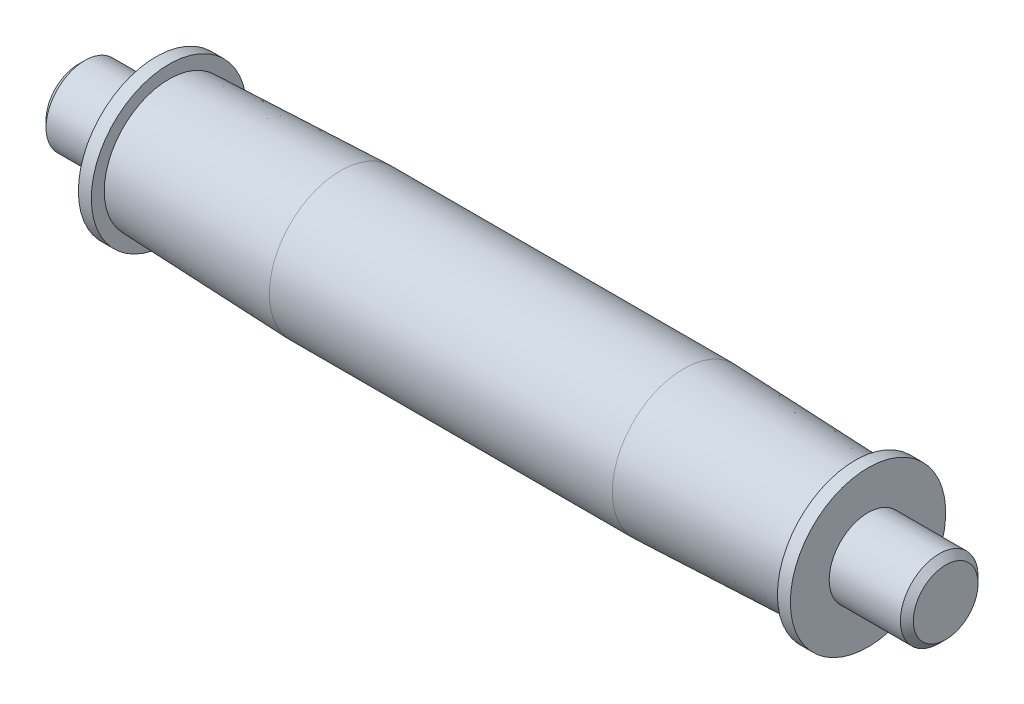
ISO-10303-21;
HEADER;
FILE_DESCRIPTION(('STEP AP214'),'2;1');
FILE_NAME('part.step','',(''),(''),'','','');
FILE_SCHEMA(('AUTOMOTIVE_DESIGN { 1 0 10303 214 1 1 1 1 }'));
ENDSEC;
DATA;
#1=APPLICATION_CONTEXT('core data for automotive mechanical design processes');
#2=APPLICATION_PROTOCOL_DEFINITION('international standard','automotive_design',2000,#1);
#3=PRODUCT_CONTEXT('',#1,'mechanical');
#4=PRODUCT('Part','Part','',(#3));
#5=PRODUCT_RELATED_PRODUCT_CATEGORY('part','',(#4));
#6=PRODUCT_DEFINITION_FORMATION('','',#4);
#7=PRODUCT_DEFINITION_CONTEXT('part definition',#1,'design');
#8=PRODUCT_DEFINITION('design','',#6,#7);
#9=PRODUCT_DEFINITION_SHAPE('','',#8);
#10=(LENGTH_UNIT() NAMED_UNIT(*) SI_UNIT(.MILLI.,.METRE.));
#11=(NAMED_UNIT(*) PLANE_ANGLE_UNIT() SI_UNIT($,.RADIAN.));
#12=(NAMED_UNIT(*) SI_UNIT($,.STERADIAN.) SOLID_ANGLE_UNIT());
#13=UNCERTAINTY_MEASURE_WITH_UNIT(LENGTH_MEASURE(1.E-05),#10,'distance_accuracy_value','');
#14=(GEOMETRIC_REPRESENTATION_CONTEXT(3) GLOBAL_UNCERTAINTY_ASSIGNED_CONTEXT((#13)) GLOBAL_UNIT_ASSIGNED_CONTEXT((#10,
#11,#12)) REPRESENTATION_CONTEXT('',''));
#15=CARTESIAN_POINT('',(0.,0.,0.));
#16=DIRECTION('',(0.,0.,1.));
#17=DIRECTION('',(1.,0.,0.));
#18=AXIS2_PLACEMENT_3D('',#15,#16,#17);
#19=CARTESIAN_POINT('',(13.9552238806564,-13.9552238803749,-300.));
#20=DIRECTION('',(-1.,0.,0.));
#21=DIRECTION('',(0.,0.,1.));
#22=AXIS2_PLACEMENT_3D('',#19,#20,#21);
#23=CONICAL_SURFACE('',#22,7.61194029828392,0.785398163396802);
#24=CARTESIAN_POINT('',(15.2238805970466,-13.9552238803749,-300.));
#25=DIRECTION('',(-1.,0.,0.));
#26=DIRECTION('',(0.,0.,1.));
#27=AXIS2_PLACEMENT_3D('',#24,#25,#26);
#28=CIRCLE('',#27,6.34328358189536);
#29=CARTESIAN_POINT('',(15.2238805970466,-13.9552238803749,-293.656716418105));
#30=VERTEX_POINT('',#29);
#31=EDGE_CURVE('E77',#30,#30,#28,.T.);
#32=ORIENTED_EDGE('',*,*,#31,.T.);
#33=EDGE_LOOP('',(#32));
#34=FACE_BOUND('',#33,.T.);
#35=CARTESIAN_POINT('',(13.9552238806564,-13.9552238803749,-300.));
#36=DIRECTION('',(-1.,0.,0.));
#37=DIRECTION('',(0.,0.,1.));
#38=AXIS2_PLACEMENT_3D('',#35,#36,#37);
#39=CIRCLE('',#38,7.61194029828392);
#40=CARTESIAN_POINT('',(13.9552238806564,-13.9552238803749,-292.388059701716));
#41=VERTEX_POINT('',#40);
#42=EDGE_CURVE('E10',#41,#41,#39,.T.);
#43=ORIENTED_EDGE('',*,*,#42,.F.);
#44=EDGE_LOOP('',(#43));
#45=FACE_BOUND('',#44,.T.);
#46=ADVANCED_FACE('F31',(#34,#45),#23,.T.);
#47=CARTESIAN_POINT('',(15.2238805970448,-13.9552238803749,-300.));
#48=DIRECTION('',(-1.,0.,0.));
#49=DIRECTION('',(0.,0.,1.));
#50=AXIS2_PLACEMENT_3D('',#47,#48,#49);
#51=CYLINDRICAL_SURFACE('',#50,7.61194029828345);
#52=ORIENTED_EDGE('',*,*,#42,.T.);
#53=EDGE_LOOP('',(#52));
#54=FACE_BOUND('',#53,.T.);
#55=CARTESIAN_POINT('',(0.,-13.9552238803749,-300.));
#56=DIRECTION('',(-1.,0.,0.));
#57=DIRECTION('',(0.,0.,1.));
#58=AXIS2_PLACEMENT_3D('',#55,#56,#57);
#59=CIRCLE('',#58,7.61194029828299);
#60=CARTESIAN_POINT('',(0.,-13.9552238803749,-292.388059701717));
#61=VERTEX_POINT('',#60);
#62=EDGE_CURVE('E37',#61,#61,#59,.T.);
#63=ORIENTED_EDGE('',*,*,#62,.F.);
#64=EDGE_LOOP('',(#63));
#65=FACE_BOUND('',#64,.T.);
#66=ADVANCED_FACE('F94',(#54,#65),#51,.T.);
#67=CARTESIAN_POINT('',(0.,1.26865671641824,-300.));
#68=DIRECTION('',(1.,0.,0.));
#69=DIRECTION('',(0.,0.,-1.));
#70=AXIS2_PLACEMENT_3D('',#67,#68,#69);
#71=PLANE('',#70);
#72=ORIENTED_EDGE('',*,*,#62,.T.);
#73=EDGE_LOOP('',(#72));
#74=FACE_BOUND('',#73,.T.);
#75=CARTESIAN_POINT('',(0.,-13.9552238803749,-300.));
#76=DIRECTION('',(-1.,0.,0.));
#77=DIRECTION('',(0.,0.,1.));
#78=AXIS2_PLACEMENT_3D('',#75,#76,#77);
#79=CIRCLE('',#78,15.2238805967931);
#80=CARTESIAN_POINT('',(0.,-13.9552238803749,-284.776119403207));
#81=VERTEX_POINT('',#80);
#82=EDGE_CURVE('E41',#81,#81,#79,.T.);
#83=ORIENTED_EDGE('',*,*,#82,.F.);
#84=EDGE_LOOP('',(#83));
#85=FACE_BOUND('',#84,.T.);
#86=ADVANCED_FACE('F98',(#74,#85),#71,.T.);
#87=CARTESIAN_POINT('',(15.2238805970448,-13.9552238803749,-300.));
#88=DIRECTION('',(-1.,0.,0.));
#89=DIRECTION('',(0.,0.,1.));
#90=AXIS2_PLACEMENT_3D('',#87,#88,#89);
#91=CYLINDRICAL_SURFACE('',#90,15.2238805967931);
#92=ORIENTED_EDGE('',*,*,#82,.T.);
#93=EDGE_LOOP('',(#92));
#94=FACE_BOUND('',#93,.T.);
#95=CARTESIAN_POINT('',(-2.53731343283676,-13.9552238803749,-300.));
#96=DIRECTION('',(-1.,0.,0.));
#97=DIRECTION('',(0.,0.,1.));
#98=AXIS2_PLACEMENT_3D('',#95,#96,#97);
#99=CIRCLE('',#98,15.2238805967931);
#100=CARTESIAN_POINT('',(-2.53731343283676,-13.9552238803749,-284.776119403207));
#101=VERTEX_POINT('',#100);
#102=EDGE_CURVE('E45',#101,#101,#99,.T.);
#103=ORIENTED_EDGE('',*,*,#102,.F.);
#104=EDGE_LOOP('',(#103));
#105=FACE_BOUND('',#104,.T.);
#106=ADVANCED_FACE('F102',(#94,#105),#91,.T.);
#107=CARTESIAN_POINT('',(-2.53731343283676,-1.26865671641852,-300.));
#108=DIRECTION('',(-1.,0.,0.));
#109=DIRECTION('',(0.,0.,1.));
#110=AXIS2_PLACEMENT_3D('',#107,#108,#109);
#111=PLANE('',#110);
#112=ORIENTED_EDGE('',*,*,#102,.T.);
#113=EDGE_LOOP('',(#112));
#114=FACE_BOUND('',#113,.T.);
#115=CARTESIAN_POINT('',(-2.53731343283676,-13.9552238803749,-300.));
#116=DIRECTION('',(-1.,0.,0.));
#117=DIRECTION('',(0.,0.,1.));
#118=AXIS2_PLACEMENT_3D('',#115,#116,#117);
#119=CIRCLE('',#118,12.6865671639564);
#120=CARTESIAN_POINT('',(-2.53731343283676,-13.9552238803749,-287.313432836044));
#121=VERTEX_POINT('',#120);
#122=EDGE_CURVE('E50',#121,#121,#119,.T.);
#123=ORIENTED_EDGE('',*,*,#122,.F.);
#124=EDGE_LOOP('',(#123));
#125=FACE_BOUND('',#124,.T.);
#126=ADVANCED_FACE('F108',(#114,#125),#111,.T.);
#127=CARTESIAN_POINT('',(-36.1567164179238,-13.9552238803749,-300.));
#128=DIRECTION('',(-1.,0.,0.));
#129=DIRECTION('',(0.,0.,1.));
#130=AXIS2_PLACEMENT_3D('',#127,#128,#129);
#131=CONICAL_SURFACE('',#130,13.9552238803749,0.0377179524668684);
#132=ORIENTED_EDGE('',*,*,#122,.T.);
#133=EDGE_LOOP('',(#132));
#134=FACE_BOUND('',#133,.T.);
#135=CARTESIAN_POINT('',(-36.1567164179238,-13.9552238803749,-300.));
#136=DIRECTION('',(-1.,0.,0.));
#137=DIRECTION('',(0.,0.,1.));
#138=AXIS2_PLACEMENT_3D('',#135,#136,#137);
#139=CIRCLE('',#138,13.9552238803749);
#140=CARTESIAN_POINT('',(-36.1567164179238,-13.9552238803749,-286.044776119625));
#141=VERTEX_POINT('',#140);
#142=EDGE_CURVE('E53',#141,#141,#139,.T.);
#143=ORIENTED_EDGE('',*,*,#142,.F.);
#144=EDGE_LOOP('',(#143));
#145=FACE_BOUND('',#144,.T.);
#146=ADVANCED_FACE('F112',(#134,#145),#131,.T.);
#147=CARTESIAN_POINT('',(15.2238805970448,-13.9552238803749,-300.));
#148=DIRECTION('',(-1.,0.,0.));
#149=DIRECTION('',(0.,0.,1.));
#150=AXIS2_PLACEMENT_3D('',#147,#148,#149);
#151=CYLINDRICAL_SURFACE('',#150,13.9552238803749);
#152=ORIENTED_EDGE('',*,*,#142,.T.);
#153=EDGE_LOOP('',(#152));
#154=FACE_BOUND('',#153,.T.);
#155=CARTESIAN_POINT('',(-103.395522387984,-13.9552238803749,-300.));
#156=DIRECTION('',(-1.,0.,0.));
#157=DIRECTION('',(0.,0.,1.));
#158=AXIS2_PLACEMENT_3D('',#155,#156,#157);
#159=CIRCLE('',#158,13.9552238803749);
#160=CARTESIAN_POINT('',(-103.395522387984,-13.9552238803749,-286.044776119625));
#161=VERTEX_POINT('',#160);
#162=EDGE_CURVE('E56',#161,#161,#159,.T.);
#163=ORIENTED_EDGE('',*,*,#162,.F.);
#164=EDGE_LOOP('',(#163));
#165=FACE_BOUND('',#164,.T.);
#166=ADVANCED_FACE('F116',(#154,#165),#151,.T.);
#167=CARTESIAN_POINT('',(-137.014925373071,-13.9552238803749,-300.));
#168=DIRECTION('',(1.,0.,0.));
#169=DIRECTION('',(0.,0.,-1.));
#170=AXIS2_PLACEMENT_3D('',#167,#168,#169);
#171=CONICAL_SURFACE('',#170,12.6865671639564,0.0377179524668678);
#172=ORIENTED_EDGE('',*,*,#162,.T.);
#173=EDGE_LOOP('',(#172));
#174=FACE_BOUND('',#173,.T.);
#175=CARTESIAN_POINT('',(-137.014925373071,-13.9552238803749,-300.));
#176=DIRECTION('',(-1.,0.,0.));
#177=DIRECTION('',(0.,0.,1.));
#178=AXIS2_PLACEMENT_3D('',#175,#176,#177);
#179=CIRCLE('',#178,12.6865671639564);
#180=CARTESIAN_POINT('',(-137.014925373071,-13.9552238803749,-287.313432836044));
#181=VERTEX_POINT('',#180);
#182=EDGE_CURVE('E59',#181,#181,#179,.T.);
#183=ORIENTED_EDGE('',*,*,#182,.F.);
#184=EDGE_LOOP('',(#183));
#185=FACE_BOUND('',#184,.T.);
#186=ADVANCED_FACE('F120',(#174,#185),#171,.T.);
#187=CARTESIAN_POINT('',(-137.014925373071,1.26865671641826,-300.));
#188=DIRECTION('',(1.,0.,0.));
#189=DIRECTION('',(0.,0.,-1.));
#190=AXIS2_PLACEMENT_3D('',#187,#188,#189);
#191=PLANE('',#190);
#192=ORIENTED_EDGE('',*,*,#182,.T.);
#193=EDGE_LOOP('',(#192));
#194=FACE_BOUND('',#193,.T.);
#195=CARTESIAN_POINT('',(-137.014925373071,-13.9552238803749,-300.));
#196=DIRECTION('',(-1.,0.,0.));
#197=DIRECTION('',(0.,0.,1.));
#198=AXIS2_PLACEMENT_3D('',#195,#196,#197);
#199=CIRCLE('',#198,15.2238805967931);
#200=CARTESIAN_POINT('',(-137.014925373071,-13.9552238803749,-284.776119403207));
#201=VERTEX_POINT('',#200);
#202=EDGE_CURVE('E62',#201,#201,#199,.T.);
#203=ORIENTED_EDGE('',*,*,#202,.F.);
#204=EDGE_LOOP('',(#203));
#205=FACE_BOUND('',#204,.T.);
#206=ADVANCED_FACE('F124',(#194,#205),#191,.T.);
#207=CARTESIAN_POINT('',(15.2238805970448,-13.9552238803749,-300.));
#208=DIRECTION('',(-1.,0.,0.));
#209=DIRECTION('',(0.,0.,1.));
#210=AXIS2_PLACEMENT_3D('',#207,#208,#209);
#211=CYLINDRICAL_SURFACE('',#210,15.2238805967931);
#212=ORIENTED_EDGE('',*,*,#202,.T.);
#213=EDGE_LOOP('',(#212));
#214=FACE_BOUND('',#213,.T.);
#215=CARTESIAN_POINT('',(-139.552238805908,-13.9552238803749,-300.));
#216=DIRECTION('',(-1.,0.,0.));
#217=DIRECTION('',(0.,0.,1.));
#218=AXIS2_PLACEMENT_3D('',#215,#216,#217);
#219=CIRCLE('',#218,15.2238805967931);
#220=CARTESIAN_POINT('',(-139.552238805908,-13.9552238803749,-284.776119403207));
#221=VERTEX_POINT('',#220);
#222=EDGE_CURVE('E65',#221,#221,#219,.T.);
#223=ORIENTED_EDGE('',*,*,#222,.F.);
#224=EDGE_LOOP('',(#223));
#225=FACE_BOUND('',#224,.T.);
#226=ADVANCED_FACE('F128',(#214,#225),#211,.T.);
#227=CARTESIAN_POINT('',(-139.552238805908,-6.34328358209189,-300.));
#228=DIRECTION('',(-1.,0.,0.));
#229=DIRECTION('',(0.,0.,1.));
#230=AXIS2_PLACEMENT_3D('',#227,#228,#229);
#231=PLANE('',#230);
#232=ORIENTED_EDGE('',*,*,#222,.T.);
#233=EDGE_LOOP('',(#232));
#234=FACE_BOUND('',#233,.T.);
#235=CARTESIAN_POINT('',(-139.552238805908,-13.9552238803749,-300.));
#236=DIRECTION('',(-1.,0.,0.));
#237=DIRECTION('',(0.,0.,1.));
#238=AXIS2_PLACEMENT_3D('',#235,#236,#237);
#239=CIRCLE('',#238,7.61194029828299);
#240=CARTESIAN_POINT('',(-139.552238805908,-13.9552238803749,-292.388059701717));
#241=VERTEX_POINT('',#240);
#242=EDGE_CURVE('E68',#241,#241,#239,.T.);
#243=ORIENTED_EDGE('',*,*,#242,.F.);
#244=EDGE_LOOP('',(#243));
#245=FACE_BOUND('',#244,.T.);
#246=ADVANCED_FACE('F132',(#234,#245),#231,.T.);
#247=CARTESIAN_POINT('',(15.2238805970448,-13.9552238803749,-300.));
#248=DIRECTION('',(-1.,0.,0.));
#249=DIRECTION('',(0.,0.,1.));
#250=AXIS2_PLACEMENT_3D('',#247,#248,#249);
#251=CYLINDRICAL_SURFACE('',#250,7.61194029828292);
#252=ORIENTED_EDGE('',*,*,#242,.T.);
#253=EDGE_LOOP('',(#252));
#254=FACE_BOUND('',#253,.T.);
#255=CARTESIAN_POINT('',(-153.507462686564,-13.9552238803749,-300.));
#256=DIRECTION('',(-1.,0.,0.));
#257=DIRECTION('',(0.,0.,1.));
#258=AXIS2_PLACEMENT_3D('',#255,#256,#257);
#259=CIRCLE('',#258,7.61194029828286);
#260=CARTESIAN_POINT('',(-153.507462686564,-13.9552238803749,-292.388059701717));
#261=VERTEX_POINT('',#260);
#262=EDGE_CURVE('E71',#261,#261,#259,.T.);
#263=ORIENTED_EDGE('',*,*,#262,.F.);
#264=EDGE_LOOP('',(#263));
#265=FACE_BOUND('',#264,.T.);
#266=ADVANCED_FACE('F136',(#254,#265),#251,.T.);
#267=CARTESIAN_POINT('',(-154.776119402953,-13.9552238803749,-300.));
#268=DIRECTION('',(1.,0.,0.));
#269=DIRECTION('',(0.,0.,-1.));
#270=AXIS2_PLACEMENT_3D('',#267,#268,#269);
#271=CONICAL_SURFACE('',#270,6.34328358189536,0.785398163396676);
#272=ORIENTED_EDGE('',*,*,#262,.T.);
#273=EDGE_LOOP('',(#272));
#274=FACE_BOUND('',#273,.T.);
#275=CARTESIAN_POINT('',(-154.776119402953,-13.9552238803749,-300.));
#276=DIRECTION('',(-1.,0.,0.));
#277=DIRECTION('',(0.,0.,1.));
#278=AXIS2_PLACEMENT_3D('',#275,#276,#277);
#279=CIRCLE('',#278,6.34328358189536);
#280=CARTESIAN_POINT('',(-154.776119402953,-13.9552238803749,-293.656716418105));
#281=VERTEX_POINT('',#280);
#282=EDGE_CURVE('E74',#281,#281,#279,.T.);
#283=ORIENTED_EDGE('',*,*,#282,.F.);
#284=EDGE_LOOP('',(#283));
#285=FACE_BOUND('',#284,.T.);
#286=ADVANCED_FACE('F90',(#274,#285),#271,.T.);
#287=CARTESIAN_POINT('',(-154.776119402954,-13.9552238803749,-300.));
#288=DIRECTION('',(-1.,0.,0.));
#289=DIRECTION('',(0.,0.,1.));
#290=AXIS2_PLACEMENT_3D('',#287,#288,#289);
#291=PLANE('',#290);
#292=ORIENTED_EDGE('',*,*,#282,.T.);
#293=EDGE_LOOP('',(#292));
#294=FACE_BOUND('',#293,.T.);
#295=ADVANCED_FACE('F85',(#294),#291,.T.);
#296=CARTESIAN_POINT('',(15.2238805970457,-7.61194029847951,-300.));
#297=DIRECTION('',(1.,0.,0.));
#298=DIRECTION('',(0.,0.,-1.));
#299=AXIS2_PLACEMENT_3D('',#296,#297,#298);
#300=PLANE('',#299);
#301=ORIENTED_EDGE('',*,*,#31,.F.);
#302=EDGE_LOOP('',(#301));
#303=FACE_BOUND('',#302,.T.);
#304=ADVANCED_FACE('F83',(#303),#300,.T.);
#305=CLOSED_SHELL('',(#46,#66,#86,#106,#126,#146,#166,#186,#206,#226,#246,#266,#286,#295,#304));
#306=MANIFOLD_SOLID_BREP('B2',#305);
#307=ADVANCED_BREP_SHAPE_REPRESENTATION('',(#18,#306),#14);
#308=SHAPE_DEFINITION_REPRESENTATION(#9,#307);
ENDSEC;
END-ISO-10303-21;
